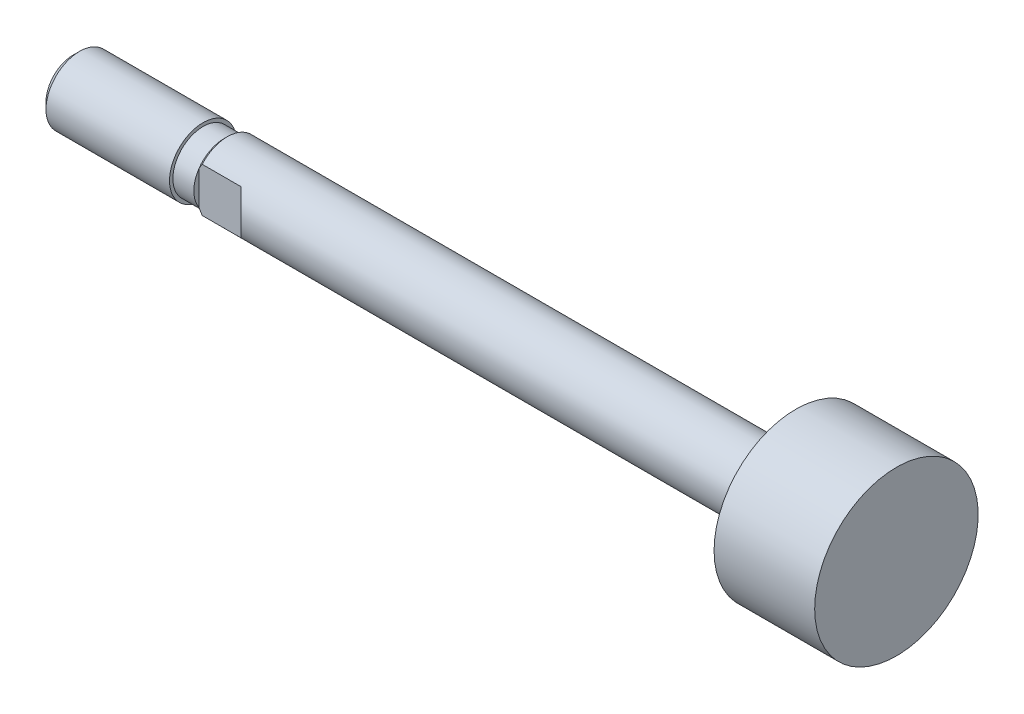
ISO-10303-21;
HEADER;
FILE_DESCRIPTION(('STEP AP214'),'2;1');
FILE_NAME('part.step','',(''),(''),'','','');
FILE_SCHEMA(('AUTOMOTIVE_DESIGN { 1 0 10303 214 1 1 1 1 }'));
ENDSEC;
DATA;
#1=APPLICATION_CONTEXT('core data for automotive mechanical design processes');
#2=APPLICATION_PROTOCOL_DEFINITION('international standard','automotive_design',2000,#1);
#3=PRODUCT_CONTEXT('',#1,'mechanical');
#4=PRODUCT('Part','Part','',(#3));
#5=PRODUCT_RELATED_PRODUCT_CATEGORY('part','',(#4));
#6=PRODUCT_DEFINITION_FORMATION('','',#4);
#7=PRODUCT_DEFINITION_CONTEXT('part definition',#1,'design');
#8=PRODUCT_DEFINITION('design','',#6,#7);
#9=PRODUCT_DEFINITION_SHAPE('','',#8);
#10=(LENGTH_UNIT() NAMED_UNIT(*) SI_UNIT(.MILLI.,.METRE.));
#11=(NAMED_UNIT(*) PLANE_ANGLE_UNIT() SI_UNIT($,.RADIAN.));
#12=(NAMED_UNIT(*) SI_UNIT($,.STERADIAN.) SOLID_ANGLE_UNIT());
#13=UNCERTAINTY_MEASURE_WITH_UNIT(LENGTH_MEASURE(1.E-05),#10,'distance_accuracy_value','');
#14=(GEOMETRIC_REPRESENTATION_CONTEXT(3) GLOBAL_UNCERTAINTY_ASSIGNED_CONTEXT((#13)) GLOBAL_UNIT_ASSIGNED_CONTEXT((#10,
#11,#12)) REPRESENTATION_CONTEXT('',''));
#15=CARTESIAN_POINT('',(0.,0.,0.));
#16=DIRECTION('',(0.,0.,1.));
#17=DIRECTION('',(1.,0.,0.));
#18=AXIS2_PLACEMENT_3D('',#15,#16,#17);
#19=CARTESIAN_POINT('',(-22.6,0.,0.));
#20=DIRECTION('',(1.,0.,0.));
#21=DIRECTION('',(0.,0.,-1.));
#22=AXIS2_PLACEMENT_3D('',#19,#20,#21);
#23=CONICAL_SURFACE('',#22,4.,0.785398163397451);
#24=CARTESIAN_POINT('',(-22.6,0.,0.));
#25=DIRECTION('',(-1.,0.,0.));
#26=DIRECTION('',(0.,0.,1.));
#27=AXIS2_PLACEMENT_3D('',#24,#25,#26);
#28=CIRCLE('',#27,4.);
#29=CARTESIAN_POINT('',(-22.6,2.64575131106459,3.));
#30=VERTEX_POINT('',#29);
#31=CARTESIAN_POINT('',(-22.6,2.64575131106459,-3.));
#32=VERTEX_POINT('',#31);
#33=EDGE_CURVE('E86',#30,#32,#28,.T.);
#34=ORIENTED_EDGE('',*,*,#33,.T.);
#35=CARTESIAN_POINT('',(-17.7938037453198,8.27943793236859,-3.));
#36=CARTESIAN_POINT('',(-17.9163046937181,8.14914098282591,-3.));
#37=CARTESIAN_POINT('',(-18.0386298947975,8.01867888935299,-3.));
#38=CARTESIAN_POINT('',(-18.2828708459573,7.75737059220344,-3.));
#39=CARTESIAN_POINT('',(-18.4047865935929,7.62652438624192,-3.));
#40=CARTESIAN_POINT('',(-18.7700034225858,7.233144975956,-3.));
#41=CARTESIAN_POINT('',(-19.0125998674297,6.9699559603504,-3.));
#42=CARTESIAN_POINT('',(-19.5014311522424,6.43443485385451,-3.));
#43=CARTESIAN_POINT('',(-19.7475991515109,6.1620416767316,-3.));
#44=CARTESIAN_POINT('',(-20.2359407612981,5.61398554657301,-3.));
#45=CARTESIAN_POINT('',(-20.4781167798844,5.33832475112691,-3.));
#46=CARTESIAN_POINT('',(-20.8369496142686,4.92114952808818,-3.));
#47=CARTESIAN_POINT('',(-20.955790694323,4.78151512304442,-3.));
#48=CARTESIAN_POINT('',(-21.1916294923,4.50070015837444,-3.));
#49=CARTESIAN_POINT('',(-21.3086272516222,4.35951963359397,-3.));
#50=CARTESIAN_POINT('',(-21.5405139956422,4.07494993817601,-3.));
#51=CARTESIAN_POINT('',(-21.6553981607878,3.93155683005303,-3.));
#52=CARTESIAN_POINT('',(-21.8820829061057,3.64236369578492,-3.));
#53=CARTESIAN_POINT('',(-21.9938837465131,3.49656387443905,-3.));
#54=CARTESIAN_POINT('',(-22.2122246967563,3.20344255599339,-3.));
#55=CARTESIAN_POINT('',(-22.31880780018,3.05615324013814,-3.));
#56=CARTESIAN_POINT('',(-22.5265277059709,2.75765952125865,-3.));
#57=CARTESIAN_POINT('',(-22.627662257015,2.60645353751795,-3.));
#58=CARTESIAN_POINT('',(-22.8218669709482,2.29964442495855,-3.));
#59=CARTESIAN_POINT('',(-22.9149640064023,2.1440584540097,-3.));
#60=CARTESIAN_POINT('',(-23.0900500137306,1.82681339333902,-3.));
#61=CARTESIAN_POINT('',(-23.1720508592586,1.66516103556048,-3.));
#62=CARTESIAN_POINT('',(-23.2868004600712,1.40852074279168,-3.));
#63=CARTESIAN_POINT('',(-23.3251737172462,1.31605500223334,-3.));
#64=CARTESIAN_POINT('',(-23.395842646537,1.12878220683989,-3.));
#65=CARTESIAN_POINT('',(-23.4281373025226,1.03397476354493,-3.));
#66=CARTESIAN_POINT('',(-23.4852218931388,0.842685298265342,-3.));
#67=CARTESIAN_POINT('',(-23.5100534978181,0.746215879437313,-3.));
#68=CARTESIAN_POINT('',(-23.5512195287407,0.551462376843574,-3.));
#69=CARTESIAN_POINT('',(-23.5675549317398,0.453178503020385,-3.));
#70=CARTESIAN_POINT('',(-23.5908977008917,0.254137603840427,-3.));
#71=CARTESIAN_POINT('',(-23.5977758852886,0.153365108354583,-3.));
#72=CARTESIAN_POINT('',(-23.6013052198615,-0.0483528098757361,-3.));
#73=CARTESIAN_POINT('',(-23.5979572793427,-0.149298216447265,-3.));
#74=CARTESIAN_POINT('',(-23.5812462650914,-0.350691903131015,-3.));
#75=CARTESIAN_POINT('',(-23.5678486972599,-0.451137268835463,-3.));
#76=CARTESIAN_POINT('',(-23.5318798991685,-0.650366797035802,-3.));
#77=CARTESIAN_POINT('',(-23.5093059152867,-0.749150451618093,-3.));
#78=CARTESIAN_POINT('',(-23.4466763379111,-0.979694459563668,-3.));
#79=CARTESIAN_POINT('',(-23.4032532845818,-1.11053429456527,-3.));
#80=CARTESIAN_POINT('',(-23.3050346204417,-1.36783734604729,-3.));
#81=CARTESIAN_POINT('',(-23.2502325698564,-1.49429803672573,-3.));
#82=CARTESIAN_POINT('',(-23.1314117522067,-1.74452516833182,-3.));
#83=CARTESIAN_POINT('',(-23.0672954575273,-1.86824475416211,-3.));
#84=CARTESIAN_POINT('',(-22.9662350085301,-2.05105206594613,-3.));
#85=CARTESIAN_POINT('',(-22.9317385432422,-2.11151833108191,-3.));
#86=CARTESIAN_POINT('',(-22.8613200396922,-2.23161200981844,-3.));
#87=CARTESIAN_POINT('',(-22.8253980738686,-2.29123946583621,-3.));
#88=CARTESIAN_POINT('',(-22.6988467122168,-2.4964453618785,-3.));
#89=CARTESIAN_POINT('',(-22.6050928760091,-2.64009919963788,-3.));
#90=CARTESIAN_POINT('',(-22.4122067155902,-2.92376510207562,-3.));
#91=CARTESIAN_POINT('',(-22.3130728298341,-3.06377609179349,-3.));
#92=CARTESIAN_POINT('',(-22.1107459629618,-3.34101559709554,-3.));
#93=CARTESIAN_POINT('',(-22.0075494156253,-3.47824150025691,-3.));
#94=CARTESIAN_POINT('',(-21.7981442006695,-3.75038163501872,-3.));
#95=CARTESIAN_POINT('',(-21.6919353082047,-3.88529569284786,-3.));
#96=CARTESIAN_POINT('',(-21.4767574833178,-4.15380403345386,-3.));
#97=CARTESIAN_POINT('',(-21.3677790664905,-4.28739069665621,-3.));
#98=CARTESIAN_POINT('',(-21.1479733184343,-4.55303616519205,-3.));
#99=CARTESIAN_POINT('',(-21.0371459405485,-4.68509493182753,-3.));
#100=CARTESIAN_POINT('',(-20.7025923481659,-5.07925546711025,-3.));
#101=CARTESIAN_POINT('',(-20.4766714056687,-5.33949344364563,-3.));
#102=CARTESIAN_POINT('',(-20.0476515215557,-5.82621409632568,-3.));
#103=CARTESIAN_POINT('',(-19.8449818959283,-6.05307754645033,-3.));
#104=CARTESIAN_POINT('',(-19.4373743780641,-6.5048206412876,-3.));
#105=CARTESIAN_POINT('',(-19.2324361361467,-6.72969997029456,-3.));
#106=CARTESIAN_POINT('',(-18.8225768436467,-7.1760769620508,-3.));
#107=CARTESIAN_POINT('',(-18.6176694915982,-7.39758722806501,-3.));
#108=CARTESIAN_POINT('',(-18.2065998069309,-7.83935984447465,-3.));
#109=CARTESIAN_POINT('',(-18.0004377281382,-8.05962243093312,-3.));
#110=CARTESIAN_POINT('',(-17.7938037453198,-8.27943793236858,-3.));
#111=B_SPLINE_CURVE_WITH_KNOTS('',3,(#35,#36,#37,#38,#39,#40,#41,#42,#43,#44,#45,#46,#47,#48,
#49,#50,#51,#52,#53,#54,#55,#56,#57,#58,#59,#60,#61,#62,#63,#64,#65,#66,#67,#68,#69,#70,#71,#72,
#73,#74,#75,#76,#77,#78,#79,#80,#81,#82,#83,#84,#85,#86,#87,#88,#89,#90,#91,#92,#93,#94,#95,#96,
#97,#98,#99,#100,#101,#102,#103,#104,#105,#106,#107,#108,#109,#110),.UNSPECIFIED.,.F.,.F.,(4,2,
2,2,2,2,2,2,2,2,2,2,2,2,2,2,2,2,2,2,2,2,2,2,2,2,2,2,2,2,2,2,2,2,2,2,2,4),(0.,0.536519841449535,
1.07304288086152,2.14685127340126,3.24827051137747,4.34899905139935,4.89906784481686,
5.44912426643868,6.00030934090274,6.55144775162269,7.09678368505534,7.64234324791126,
8.18600179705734,8.72907391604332,9.02924224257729,9.32946070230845,9.62797034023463,
9.92644565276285,10.2289588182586,10.5314450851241,10.834974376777,11.1385948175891,
11.5514371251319,11.9645137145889,12.3822775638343,12.5911065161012,12.7999248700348,
13.3143532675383,13.8289317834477,14.3439725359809,14.8590518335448,15.3762303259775,
15.8934218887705,16.9272181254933,17.8398246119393,18.7525737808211,19.6578221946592,
20.5628931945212),.UNSPECIFIED.);
#112=CARTESIAN_POINT('',(-23.,1.98997487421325,-3.));
#113=VERTEX_POINT('',#112);
#114=EDGE_CURVE('E161',#32,#113,#111,.T.);
#115=ORIENTED_EDGE('',*,*,#114,.T.);
#116=CARTESIAN_POINT('',(-23.,0.,0.));
#117=DIRECTION('',(-1.,0.,0.));
#118=DIRECTION('',(0.,0.,1.));
#119=AXIS2_PLACEMENT_3D('',#116,#117,#118);
#120=CIRCLE('',#119,3.6);
#121=CARTESIAN_POINT('',(-23.,1.98997487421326,3.));
#122=VERTEX_POINT('',#121);
#123=EDGE_CURVE('E169',#122,#113,#120,.T.);
#124=ORIENTED_EDGE('',*,*,#123,.F.);
#125=CARTESIAN_POINT('',(-17.7938037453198,-8.27943793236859,3.));
#126=CARTESIAN_POINT('',(-17.9163046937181,-8.14914098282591,3.));
#127=CARTESIAN_POINT('',(-18.0386298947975,-8.01867888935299,3.));
#128=CARTESIAN_POINT('',(-18.2828708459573,-7.75737059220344,3.));
#129=CARTESIAN_POINT('',(-18.4047865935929,-7.62652438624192,3.));
#130=CARTESIAN_POINT('',(-18.7700034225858,-7.233144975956,3.));
#131=CARTESIAN_POINT('',(-19.0125998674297,-6.9699559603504,3.));
#132=CARTESIAN_POINT('',(-19.5014311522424,-6.43443485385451,3.));
#133=CARTESIAN_POINT('',(-19.7475991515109,-6.1620416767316,3.));
#134=CARTESIAN_POINT('',(-20.2359407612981,-5.61398554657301,3.));
#135=CARTESIAN_POINT('',(-20.4781167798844,-5.33832475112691,3.));
#136=CARTESIAN_POINT('',(-20.8369496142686,-4.92114952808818,3.));
#137=CARTESIAN_POINT('',(-20.955790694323,-4.78151512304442,3.));
#138=CARTESIAN_POINT('',(-21.1916294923,-4.50070015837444,3.));
#139=CARTESIAN_POINT('',(-21.3086272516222,-4.35951963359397,3.));
#140=CARTESIAN_POINT('',(-21.5405139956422,-4.07494993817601,3.));
#141=CARTESIAN_POINT('',(-21.6553981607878,-3.93155683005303,3.));
#142=CARTESIAN_POINT('',(-21.8820829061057,-3.64236369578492,3.));
#143=CARTESIAN_POINT('',(-21.9938837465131,-3.49656387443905,3.));
#144=CARTESIAN_POINT('',(-22.2122246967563,-3.20344255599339,3.));
#145=CARTESIAN_POINT('',(-22.31880780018,-3.05615324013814,3.));
#146=CARTESIAN_POINT('',(-22.5265277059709,-2.75765952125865,3.));
#147=CARTESIAN_POINT('',(-22.627662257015,-2.60645353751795,3.));
#148=CARTESIAN_POINT('',(-22.8218669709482,-2.29964442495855,3.));
#149=CARTESIAN_POINT('',(-22.9149640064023,-2.1440584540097,3.));
#150=CARTESIAN_POINT('',(-23.0900500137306,-1.82681339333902,3.));
#151=CARTESIAN_POINT('',(-23.1720508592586,-1.66516103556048,3.));
#152=CARTESIAN_POINT('',(-23.2868004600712,-1.40852074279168,3.));
#153=CARTESIAN_POINT('',(-23.3251737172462,-1.31605500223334,3.));
#154=CARTESIAN_POINT('',(-23.395842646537,-1.12878220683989,3.));
#155=CARTESIAN_POINT('',(-23.4281373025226,-1.03397476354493,3.));
#156=CARTESIAN_POINT('',(-23.4852218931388,-0.842685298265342,3.));
#157=CARTESIAN_POINT('',(-23.5100534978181,-0.746215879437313,3.));
#158=CARTESIAN_POINT('',(-23.5512195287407,-0.551462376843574,3.));
#159=CARTESIAN_POINT('',(-23.5675549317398,-0.453178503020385,3.));
#160=CARTESIAN_POINT('',(-23.5908977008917,-0.254137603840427,3.));
#161=CARTESIAN_POINT('',(-23.5977758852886,-0.153365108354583,3.));
#162=CARTESIAN_POINT('',(-23.6013052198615,0.0483528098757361,3.));
#163=CARTESIAN_POINT('',(-23.5979572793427,0.149298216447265,3.));
#164=CARTESIAN_POINT('',(-23.5812462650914,0.350691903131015,3.));
#165=CARTESIAN_POINT('',(-23.5678486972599,0.451137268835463,3.));
#166=CARTESIAN_POINT('',(-23.5318798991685,0.650366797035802,3.));
#167=CARTESIAN_POINT('',(-23.5093059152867,0.749150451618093,3.));
#168=CARTESIAN_POINT('',(-23.4466763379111,0.979694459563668,3.));
#169=CARTESIAN_POINT('',(-23.4032532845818,1.11053429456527,3.));
#170=CARTESIAN_POINT('',(-23.3050346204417,1.36783734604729,3.));
#171=CARTESIAN_POINT('',(-23.2502325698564,1.49429803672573,3.));
#172=CARTESIAN_POINT('',(-23.1314117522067,1.74452516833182,3.));
#173=CARTESIAN_POINT('',(-23.0672954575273,1.86824475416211,3.));
#174=CARTESIAN_POINT('',(-22.9662350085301,2.05105206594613,3.));
#175=CARTESIAN_POINT('',(-22.9317385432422,2.11151833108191,3.));
#176=CARTESIAN_POINT('',(-22.8613200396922,2.23161200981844,3.));
#177=CARTESIAN_POINT('',(-22.8253980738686,2.29123946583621,3.));
#178=CARTESIAN_POINT('',(-22.6988467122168,2.4964453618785,3.));
#179=CARTESIAN_POINT('',(-22.6050928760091,2.64009919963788,3.));
#180=CARTESIAN_POINT('',(-22.4122067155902,2.92376510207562,3.));
#181=CARTESIAN_POINT('',(-22.3130728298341,3.06377609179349,3.));
#182=CARTESIAN_POINT('',(-22.1107459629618,3.34101559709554,3.));
#183=CARTESIAN_POINT('',(-22.0075494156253,3.47824150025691,3.));
#184=CARTESIAN_POINT('',(-21.7981442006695,3.75038163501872,3.));
#185=CARTESIAN_POINT('',(-21.6919353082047,3.88529569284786,3.));
#186=CARTESIAN_POINT('',(-21.4767574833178,4.15380403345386,3.));
#187=CARTESIAN_POINT('',(-21.3677790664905,4.28739069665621,3.));
#188=CARTESIAN_POINT('',(-21.1479733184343,4.55303616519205,3.));
#189=CARTESIAN_POINT('',(-21.0371459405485,4.68509493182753,3.));
#190=CARTESIAN_POINT('',(-20.7025923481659,5.07925546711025,3.));
#191=CARTESIAN_POINT('',(-20.4766714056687,5.33949344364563,3.));
#192=CARTESIAN_POINT('',(-20.0476515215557,5.82621409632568,3.));
#193=CARTESIAN_POINT('',(-19.8449818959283,6.05307754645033,3.));
#194=CARTESIAN_POINT('',(-19.4373743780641,6.5048206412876,3.));
#195=CARTESIAN_POINT('',(-19.2324361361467,6.72969997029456,3.));
#196=CARTESIAN_POINT('',(-18.8225768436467,7.1760769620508,3.));
#197=CARTESIAN_POINT('',(-18.6176694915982,7.39758722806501,3.));
#198=CARTESIAN_POINT('',(-18.2065998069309,7.83935984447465,3.));
#199=CARTESIAN_POINT('',(-18.0004377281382,8.05962243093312,3.));
#200=CARTESIAN_POINT('',(-17.7938037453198,8.27943793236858,3.));
#201=B_SPLINE_CURVE_WITH_KNOTS('',3,(#125,#126,#127,#128,#129,#130,#131,#132,#133,#134,#135,
#136,#137,#138,#139,#140,#141,#142,#143,#144,#145,#146,#147,#148,#149,#150,#151,#152,#153,#154,
#155,#156,#157,#158,#159,#160,#161,#162,#163,#164,#165,#166,#167,#168,#169,#170,#171,#172,#173,
#174,#175,#176,#177,#178,#179,#180,#181,#182,#183,#184,#185,#186,#187,#188,#189,#190,#191,#192,
#193,#194,#195,#196,#197,#198,#199,#200),.UNSPECIFIED.,.F.,.F.,(4,2,2,2,2,2,2,2,2,2,2,2,2,2,2,2,
2,2,2,2,2,2,2,2,2,2,2,2,2,2,2,2,2,2,2,2,2,4),(0.,0.536519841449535,1.07304288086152,
2.14685127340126,3.24827051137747,4.34899905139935,4.89906784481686,5.44912426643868,
6.00030934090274,6.55144775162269,7.09678368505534,7.64234324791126,8.18600179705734,
8.72907391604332,9.02924224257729,9.32946070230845,9.62797034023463,9.92644565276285,
10.2289588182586,10.5314450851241,10.834974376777,11.1385948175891,11.5514371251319,
11.9645137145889,12.3822775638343,12.5911065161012,12.7999248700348,13.3143532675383,
13.8289317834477,14.3439725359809,14.8590518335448,15.3762303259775,15.8934218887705,
16.9272181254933,17.8398246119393,18.7525737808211,19.6578221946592,20.5628931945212),.UNSPECIFIED.);
#202=EDGE_CURVE('E96',#122,#30,#201,.T.);
#203=ORIENTED_EDGE('',*,*,#202,.T.);
#204=EDGE_LOOP('',(#34,#115,#124,#203));
#205=FACE_BOUND('',#204,.T.);
#206=ADVANCED_FACE('F16',(#205),#23,.T.);
#207=CARTESIAN_POINT('',(-41.,0.,0.));
#208=DIRECTION('',(1.,0.,0.));
#209=DIRECTION('',(0.,0.,-1.));
#210=AXIS2_PLACEMENT_3D('',#207,#208,#209);
#211=PLANE('',#210);
#212=CARTESIAN_POINT('',(-41.,0.,0.));
#213=DIRECTION('',(-1.,0.,0.));
#214=DIRECTION('',(0.,0.,1.));
#215=AXIS2_PLACEMENT_3D('',#212,#213,#214);
#216=CIRCLE('',#215,3.233);
#217=CARTESIAN_POINT('',(-41.,0.,3.233));
#218=VERTEX_POINT('',#217);
#219=EDGE_CURVE('E73',#218,#218,#216,.T.);
#220=ORIENTED_EDGE('',*,*,#219,.T.);
#221=EDGE_LOOP('',(#220));
#222=FACE_BOUND('',#221,.T.);
#223=ADVANCED_FACE('F18',(#222),#211,.F.);
#224=CARTESIAN_POINT('',(-40.233,0.,0.));
#225=DIRECTION('',(1.,0.,0.));
#226=DIRECTION('',(0.,0.,-1.));
#227=AXIS2_PLACEMENT_3D('',#224,#225,#226);
#228=CONICAL_SURFACE('',#227,4.,0.785398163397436);
#229=ORIENTED_EDGE('',*,*,#219,.F.);
#230=EDGE_LOOP('',(#229));
#231=FACE_BOUND('',#230,.T.);
#232=CARTESIAN_POINT('',(-40.233,0.,0.));
#233=DIRECTION('',(-1.,0.,0.));
#234=DIRECTION('',(0.,0.,1.));
#235=AXIS2_PLACEMENT_3D('',#232,#233,#234);
#236=CIRCLE('',#235,4.);
#237=CARTESIAN_POINT('',(-40.233,0.,4.));
#238=VERTEX_POINT('',#237);
#239=EDGE_CURVE('E182',#238,#238,#236,.T.);
#240=ORIENTED_EDGE('',*,*,#239,.T.);
#241=EDGE_LOOP('',(#240));
#242=FACE_BOUND('',#241,.T.);
#243=ADVANCED_FACE('F157',(#231,#242),#228,.T.);
#244=CARTESIAN_POINT('',(57.2,0.,0.));
#245=DIRECTION('',(-1.,0.,0.));
#246=DIRECTION('',(0.,0.,1.));
#247=AXIS2_PLACEMENT_3D('',#244,#245,#246);
#248=CYLINDRICAL_SURFACE('',#247,4.);
#249=ORIENTED_EDGE('',*,*,#239,.F.);
#250=EDGE_LOOP('',(#249));
#251=FACE_BOUND('',#250,.T.);
#252=CARTESIAN_POINT('',(-25.5,0.,0.));
#253=DIRECTION('',(-1.,0.,0.));
#254=DIRECTION('',(0.,0.,1.));
#255=AXIS2_PLACEMENT_3D('',#252,#253,#254);
#256=CIRCLE('',#255,4.);
#257=CARTESIAN_POINT('',(-25.5,0.,4.));
#258=VERTEX_POINT('',#257);
#259=EDGE_CURVE('E179',#258,#258,#256,.T.);
#260=ORIENTED_EDGE('',*,*,#259,.T.);
#261=EDGE_LOOP('',(#260));
#262=FACE_BOUND('',#261,.T.);
#263=ADVANCED_FACE('F189',(#251,#262),#248,.T.);
#264=CARTESIAN_POINT('',(-25.5,4.,0.));
#265=DIRECTION('',(-1.,0.,0.));
#266=DIRECTION('',(0.,0.,1.));
#267=AXIS2_PLACEMENT_3D('',#264,#265,#266);
#268=PLANE('',#267);
#269=ORIENTED_EDGE('',*,*,#259,.F.);
#270=EDGE_LOOP('',(#269));
#271=FACE_BOUND('',#270,.T.);
#272=CARTESIAN_POINT('',(-25.5,0.,0.));
#273=DIRECTION('',(-1.,0.,0.));
#274=DIRECTION('',(0.,0.,1.));
#275=AXIS2_PLACEMENT_3D('',#272,#273,#274);
#276=CIRCLE('',#275,3.6);
#277=CARTESIAN_POINT('',(-25.5,0.,3.6));
#278=VERTEX_POINT('',#277);
#279=EDGE_CURVE('E175',#278,#278,#276,.T.);
#280=ORIENTED_EDGE('',*,*,#279,.T.);
#281=EDGE_LOOP('',(#280));
#282=FACE_BOUND('',#281,.T.);
#283=ADVANCED_FACE('F193',(#271,#282),#268,.F.);
#284=CARTESIAN_POINT('',(57.2,0.,0.));
#285=DIRECTION('',(-1.,0.,0.));
#286=DIRECTION('',(0.,0.,1.));
#287=AXIS2_PLACEMENT_3D('',#284,#285,#286);
#288=CYLINDRICAL_SURFACE('',#287,3.6);
#289=ORIENTED_EDGE('',*,*,#279,.F.);
#290=EDGE_LOOP('',(#289));
#291=FACE_BOUND('',#290,.T.);
#292=ORIENTED_EDGE('',*,*,#123,.T.);
#293=CARTESIAN_POINT('',(-23.,-1.98997487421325,-3.));
#294=VERTEX_POINT('',#293);
#295=EDGE_CURVE('E176',#113,#294,#120,.T.);
#296=ORIENTED_EDGE('',*,*,#295,.T.);
#297=CARTESIAN_POINT('',(-23.,-1.98997487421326,3.));
#298=VERTEX_POINT('',#297);
#299=EDGE_CURVE('E167',#294,#298,#120,.T.);
#300=ORIENTED_EDGE('',*,*,#299,.T.);
#301=EDGE_CURVE('E163',#298,#122,#120,.T.);
#302=ORIENTED_EDGE('',*,*,#301,.T.);
#303=EDGE_LOOP('',(#292,#296,#300,#302));
#304=FACE_BOUND('',#303,.T.);
#305=ADVANCED_FACE('F148',(#291,#304),#288,.T.);
#306=ORIENTED_EDGE('',*,*,#299,.F.);
#307=CARTESIAN_POINT('',(-22.6,-2.64575131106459,-3.));
#308=VERTEX_POINT('',#307);
#309=EDGE_CURVE('E112',#294,#308,#111,.T.);
#310=ORIENTED_EDGE('',*,*,#309,.T.);
#311=CARTESIAN_POINT('',(-22.6,-2.64575131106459,3.));
#312=VERTEX_POINT('',#311);
#313=EDGE_CURVE('E164',#308,#312,#28,.T.);
#314=ORIENTED_EDGE('',*,*,#313,.T.);
#315=EDGE_CURVE('E99',#312,#298,#201,.T.);
#316=ORIENTED_EDGE('',*,*,#315,.T.);
#317=EDGE_LOOP('',(#306,#310,#314,#316));
#318=FACE_BOUND('',#317,.T.);
#319=ADVANCED_FACE('F119',(#318),#23,.T.);
#320=CARTESIAN_POINT('',(57.2,0.,0.));
#321=DIRECTION('',(-1.,0.,0.));
#322=DIRECTION('',(0.,0.,1.));
#323=AXIS2_PLACEMENT_3D('',#320,#321,#322);
#324=CYLINDRICAL_SURFACE('',#323,4.);
#325=CARTESIAN_POINT('',(-21.,0.,0.));
#326=DIRECTION('',(0.707106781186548,0.,0.707106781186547));
#327=DIRECTION('',(-0.707106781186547,0.,0.707106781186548));
#328=AXIS2_PLACEMENT_3D('',#325,#326,#327);
#329=ELLIPSE('',#328,5.65685424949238,4.);
#330=CARTESIAN_POINT('',(-18.,-2.64575131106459,-3.));
#331=VERTEX_POINT('',#330);
#332=CARTESIAN_POINT('',(-18.,2.64575131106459,-3.));
#333=VERTEX_POINT('',#332);
#334=EDGE_CURVE('E24',#331,#333,#329,.T.);
#335=ORIENTED_EDGE('',*,*,#334,.T.);
#336=DIRECTION('',(-1.,0.,0.));
#337=VECTOR('',#336,1.);
#338=CARTESIAN_POINT('',(57.2,2.64575131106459,-3.));
#339=LINE('',#338,#337);
#340=EDGE_CURVE('E11',#333,#32,#339,.T.);
#341=ORIENTED_EDGE('',*,*,#340,.T.);
#342=ORIENTED_EDGE('',*,*,#33,.F.);
#343=DIRECTION('',(-1.,0.,0.));
#344=VECTOR('',#343,1.);
#345=CARTESIAN_POINT('',(57.2,2.64575131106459,3.));
#346=LINE('',#345,#344);
#347=CARTESIAN_POINT('',(-18.,2.64575131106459,3.));
#348=VERTEX_POINT('',#347);
#349=EDGE_CURVE('E72',#30,#348,#346,.F.);
#350=ORIENTED_EDGE('',*,*,#349,.T.);
#351=CARTESIAN_POINT('',(-21.,0.,0.));
#352=DIRECTION('',(0.707106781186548,0.,-0.707106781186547));
#353=DIRECTION('',(-0.707106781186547,0.,-0.707106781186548));
#354=AXIS2_PLACEMENT_3D('',#351,#352,#353);
#355=ELLIPSE('',#354,5.65685424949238,4.);
#356=CARTESIAN_POINT('',(-18.,-2.64575131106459,3.));
#357=VERTEX_POINT('',#356);
#358=EDGE_CURVE('E67',#348,#357,#355,.T.);
#359=ORIENTED_EDGE('',*,*,#358,.T.);
#360=DIRECTION('',(-1.,0.,0.));
#361=VECTOR('',#360,1.);
#362=CARTESIAN_POINT('',(57.2,-2.64575131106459,3.));
#363=LINE('',#362,#361);
#364=EDGE_CURVE('E78',#357,#312,#363,.T.);
#365=ORIENTED_EDGE('',*,*,#364,.T.);
#366=ORIENTED_EDGE('',*,*,#313,.F.);
#367=DIRECTION('',(-1.,0.,0.));
#368=VECTOR('',#367,1.);
#369=CARTESIAN_POINT('',(57.2,-2.64575131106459,-3.));
#370=LINE('',#369,#368);
#371=EDGE_CURVE('E88',#308,#331,#370,.F.);
#372=ORIENTED_EDGE('',*,*,#371,.T.);
#373=EDGE_LOOP('',(#335,#341,#342,#350,#359,#365,#366,#372));
#374=FACE_BOUND('',#373,.T.);
#375=CARTESIAN_POINT('',(45.2,0.,0.));
#376=DIRECTION('',(-1.,0.,0.));
#377=DIRECTION('',(0.,0.,1.));
#378=AXIS2_PLACEMENT_3D('',#375,#376,#377);
#379=CIRCLE('',#378,4.);
#380=CARTESIAN_POINT('',(45.2,0.,4.));
#381=VERTEX_POINT('',#380);
#382=EDGE_CURVE('E171',#381,#381,#379,.T.);
#383=ORIENTED_EDGE('',*,*,#382,.T.);
#384=EDGE_LOOP('',(#383));
#385=FACE_BOUND('',#384,.T.);
#386=ADVANCED_FACE('F83',(#374,#385),#324,.T.);
#387=CARTESIAN_POINT('',(45.2,4.,0.));
#388=DIRECTION('',(1.,0.,0.));
#389=DIRECTION('',(0.,0.,-1.));
#390=AXIS2_PLACEMENT_3D('',#387,#388,#389);
#391=PLANE('',#390);
#392=ORIENTED_EDGE('',*,*,#382,.F.);
#393=EDGE_LOOP('',(#392));
#394=FACE_BOUND('',#393,.T.);
#395=CARTESIAN_POINT('',(45.2,0.,0.));
#396=DIRECTION('',(-1.,0.,0.));
#397=DIRECTION('',(0.,0.,1.));
#398=AXIS2_PLACEMENT_3D('',#395,#396,#397);
#399=CIRCLE('',#398,9.75);
#400=CARTESIAN_POINT('',(45.2,0.,9.75));
#401=VERTEX_POINT('',#400);
#402=EDGE_CURVE('E213',#401,#401,#399,.T.);
#403=ORIENTED_EDGE('',*,*,#402,.T.);
#404=EDGE_LOOP('',(#403));
#405=FACE_BOUND('',#404,.T.);
#406=ADVANCED_FACE('F138',(#394,#405),#391,.F.);
#407=CARTESIAN_POINT('',(57.2,0.,0.));
#408=DIRECTION('',(-1.,0.,0.));
#409=DIRECTION('',(0.,0.,1.));
#410=AXIS2_PLACEMENT_3D('',#407,#408,#409);
#411=CYLINDRICAL_SURFACE('',#410,9.75);
#412=ORIENTED_EDGE('',*,*,#402,.F.);
#413=EDGE_LOOP('',(#412));
#414=FACE_BOUND('',#413,.T.);
#415=CARTESIAN_POINT('',(57.2,0.,0.));
#416=DIRECTION('',(-1.,0.,0.));
#417=DIRECTION('',(0.,0.,1.));
#418=AXIS2_PLACEMENT_3D('',#415,#416,#417);
#419=CIRCLE('',#418,9.75);
#420=CARTESIAN_POINT('',(57.2,0.,9.75));
#421=VERTEX_POINT('',#420);
#422=EDGE_CURVE('E211',#421,#421,#419,.T.);
#423=ORIENTED_EDGE('',*,*,#422,.T.);
#424=EDGE_LOOP('',(#423));
#425=FACE_BOUND('',#424,.T.);
#426=ADVANCED_FACE('F134',(#414,#425),#411,.T.);
#427=CARTESIAN_POINT('',(57.2,9.75,0.));
#428=DIRECTION('',(-1.,0.,0.));
#429=DIRECTION('',(0.,0.,1.));
#430=AXIS2_PLACEMENT_3D('',#427,#428,#429);
#431=PLANE('',#430);
#432=ORIENTED_EDGE('',*,*,#422,.F.);
#433=EDGE_LOOP('',(#432));
#434=FACE_BOUND('',#433,.T.);
#435=ADVANCED_FACE('F131',(#434),#431,.F.);
#436=CARTESIAN_POINT('',(-9.,-4.,12.));
#437=DIRECTION('',(0.707106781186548,0.,-0.707106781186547));
#438=DIRECTION('',(-0.707106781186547,0.,-0.707106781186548));
#439=AXIS2_PLACEMENT_3D('',#436,#437,#438);
#440=PLANE('',#439);
#441=DIRECTION('',(0.,1.,0.));
#442=VECTOR('',#441,1.);
#443=CARTESIAN_POINT('',(-18.,-4.,3.));
#444=LINE('',#443,#442);
#445=EDGE_CURVE('E38',#357,#348,#444,.T.);
#446=ORIENTED_EDGE('',*,*,#445,.F.);
#447=ORIENTED_EDGE('',*,*,#358,.F.);
#448=EDGE_LOOP('',(#446,#447));
#449=FACE_BOUND('',#448,.T.);
#450=ADVANCED_FACE('F68',(#449),#440,.F.);
#451=CARTESIAN_POINT('',(-18.,-4.,3.));
#452=DIRECTION('',(0.,0.,-1.));
#453=DIRECTION('',(-1.,0.,0.));
#454=AXIS2_PLACEMENT_3D('',#451,#452,#453);
#455=PLANE('',#454);
#456=ORIENTED_EDGE('',*,*,#364,.F.);
#457=ORIENTED_EDGE('',*,*,#445,.T.);
#458=ORIENTED_EDGE('',*,*,#349,.F.);
#459=ORIENTED_EDGE('',*,*,#202,.F.);
#460=DIRECTION('',(0.,1.,0.));
#461=VECTOR('',#460,1.);
#462=CARTESIAN_POINT('',(-23.,-4.,3.));
#463=LINE('',#462,#461);
#464=EDGE_CURVE('E79',#298,#122,#463,.T.);
#465=ORIENTED_EDGE('',*,*,#464,.F.);
#466=ORIENTED_EDGE('',*,*,#315,.F.);
#467=EDGE_LOOP('',(#456,#457,#458,#459,#465,#466));
#468=FACE_BOUND('',#467,.T.);
#469=ADVANCED_FACE('F76',(#468),#455,.F.);
#470=CARTESIAN_POINT('',(-23.,-4.,3.));
#471=DIRECTION('',(-1.,0.,0.));
#472=DIRECTION('',(0.,0.,1.));
#473=AXIS2_PLACEMENT_3D('',#470,#471,#472);
#474=PLANE('',#473);
#475=ORIENTED_EDGE('',*,*,#464,.T.);
#476=ORIENTED_EDGE('',*,*,#301,.F.);
#477=EDGE_LOOP('',(#475,#476));
#478=FACE_BOUND('',#477,.T.);
#479=ADVANCED_FACE('F127',(#478),#474,.F.);
#480=CARTESIAN_POINT('',(-23.,-4.,-4.));
#481=DIRECTION('',(-1.,0.,0.));
#482=DIRECTION('',(0.,0.,1.));
#483=AXIS2_PLACEMENT_3D('',#480,#481,#482);
#484=PLANE('',#483);
#485=DIRECTION('',(0.,1.,0.));
#486=VECTOR('',#485,1.);
#487=CARTESIAN_POINT('',(-23.,-4.,-3.));
#488=LINE('',#487,#486);
#489=EDGE_CURVE('E97',#294,#113,#488,.T.);
#490=ORIENTED_EDGE('',*,*,#489,.F.);
#491=ORIENTED_EDGE('',*,*,#295,.F.);
#492=EDGE_LOOP('',(#490,#491));
#493=FACE_BOUND('',#492,.T.);
#494=ADVANCED_FACE('F224',(#493),#484,.F.);
#495=CARTESIAN_POINT('',(-18.,-4.,-3.));
#496=DIRECTION('',(0.707106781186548,0.,0.707106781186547));
#497=DIRECTION('',(0.707106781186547,0.,-0.707106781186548));
#498=AXIS2_PLACEMENT_3D('',#495,#496,#497);
#499=PLANE('',#498);
#500=DIRECTION('',(0.,1.,0.));
#501=VECTOR('',#500,1.);
#502=CARTESIAN_POINT('',(-18.,-4.,-3.));
#503=LINE('',#502,#501);
#504=EDGE_CURVE('E31',#331,#333,#503,.T.);
#505=ORIENTED_EDGE('',*,*,#504,.T.);
#506=ORIENTED_EDGE('',*,*,#334,.F.);
#507=EDGE_LOOP('',(#505,#506));
#508=FACE_BOUND('',#507,.T.);
#509=ADVANCED_FACE('F95',(#508),#499,.F.);
#510=CARTESIAN_POINT('',(-23.,-4.,-3.));
#511=DIRECTION('',(0.,0.,1.));
#512=DIRECTION('',(1.,0.,0.));
#513=AXIS2_PLACEMENT_3D('',#510,#511,#512);
#514=PLANE('',#513);
#515=ORIENTED_EDGE('',*,*,#340,.F.);
#516=ORIENTED_EDGE('',*,*,#504,.F.);
#517=ORIENTED_EDGE('',*,*,#371,.F.);
#518=ORIENTED_EDGE('',*,*,#309,.F.);
#519=ORIENTED_EDGE('',*,*,#489,.T.);
#520=ORIENTED_EDGE('',*,*,#114,.F.);
#521=EDGE_LOOP('',(#515,#516,#517,#518,#519,#520));
#522=FACE_BOUND('',#521,.T.);
#523=ADVANCED_FACE('F222',(#522),#514,.F.);
#524=CLOSED_SHELL('',(#206,#223,#243,#263,#283,#305,#319,#386,#406,#426,#435,#450,#469,#479,
#494,#509,#523));
#525=MANIFOLD_SOLID_BREP('B1',#524);
#526=ADVANCED_BREP_SHAPE_REPRESENTATION('',(#18,#525),#14);
#527=SHAPE_DEFINITION_REPRESENTATION(#9,#526);
ENDSEC;
END-ISO-10303-21;
